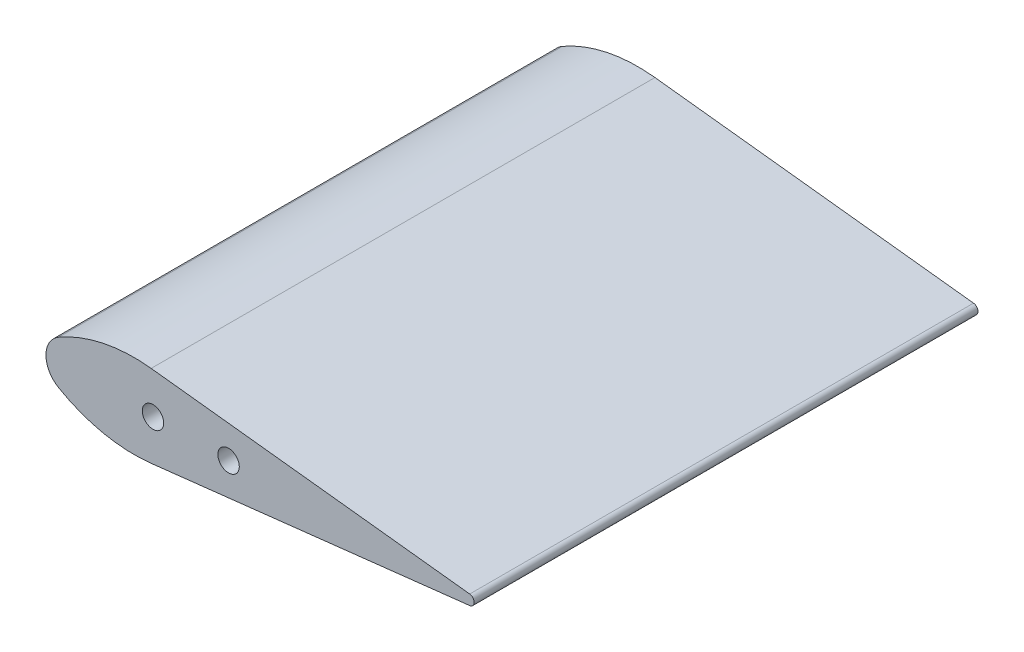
ISO-10303-21;
HEADER;
FILE_DESCRIPTION(('STEP AP214'),'2;1');
FILE_NAME('part.step','',(''),(''),'','','');
FILE_SCHEMA(('AUTOMOTIVE_DESIGN { 1 0 10303 214 1 1 1 1 }'));
ENDSEC;
DATA;
#1=APPLICATION_CONTEXT('core data for automotive mechanical design processes');
#2=APPLICATION_PROTOCOL_DEFINITION('international standard','automotive_design',2000,#1);
#3=PRODUCT_CONTEXT('',#1,'mechanical');
#4=PRODUCT('Part','Part','',(#3));
#5=PRODUCT_RELATED_PRODUCT_CATEGORY('part','',(#4));
#6=PRODUCT_DEFINITION_FORMATION('','',#4);
#7=PRODUCT_DEFINITION_CONTEXT('part definition',#1,'design');
#8=PRODUCT_DEFINITION('design','',#6,#7);
#9=PRODUCT_DEFINITION_SHAPE('','',#8);
#10=(LENGTH_UNIT() NAMED_UNIT(*) SI_UNIT(.MILLI.,.METRE.));
#11=(NAMED_UNIT(*) PLANE_ANGLE_UNIT() SI_UNIT($,.RADIAN.));
#12=(NAMED_UNIT(*) SI_UNIT($,.STERADIAN.) SOLID_ANGLE_UNIT());
#13=UNCERTAINTY_MEASURE_WITH_UNIT(LENGTH_MEASURE(1.E-05),#10,'distance_accuracy_value','');
#14=(GEOMETRIC_REPRESENTATION_CONTEXT(3) GLOBAL_UNCERTAINTY_ASSIGNED_CONTEXT((#13)) GLOBAL_UNIT_ASSIGNED_CONTEXT((#10,
#11,#12)) REPRESENTATION_CONTEXT('',''));
#15=CARTESIAN_POINT('',(0.,0.,0.));
#16=DIRECTION('',(0.,0.,1.));
#17=DIRECTION('',(1.,0.,0.));
#18=AXIS2_PLACEMENT_3D('',#15,#16,#17);
#19=CARTESIAN_POINT('',(-160.000000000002,1.08940634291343E-12,200.));
#20=DIRECTION('',(0.,0.,-1.));
#21=DIRECTION('',(-1.,0.,0.));
#22=AXIS2_PLACEMENT_3D('',#19,#20,#21);
#23=CYLINDRICAL_SURFACE('',#22,10.);
#24=CARTESIAN_POINT('',(-160.000000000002,5.41233724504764E-13,0.));
#25=DIRECTION('',(0.,0.,1.));
#26=DIRECTION('',(1.,0.,0.));
#27=AXIS2_PLACEMENT_3D('',#24,#25,#26);
#28=CIRCLE('',#27,10.);
#29=CARTESIAN_POINT('',(-165.,8.66025403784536,-8.1601392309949E-12));
#30=VERTEX_POINT('',#29);
#31=CARTESIAN_POINT('',(-165.,-8.66025403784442,-8.1601392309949E-12));
#32=VERTEX_POINT('',#31);
#33=EDGE_CURVE('E131',#30,#32,#28,.T.);
#34=ORIENTED_EDGE('',*,*,#33,.T.);
#35=DIRECTION('',(0.,0.,-1.));
#36=VECTOR('',#35,1.);
#37=CARTESIAN_POINT('',(-165.,-8.66025403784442,199.999999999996));
#38=LINE('',#37,#36);
#39=CARTESIAN_POINT('',(-165.,-8.66025403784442,199.999999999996));
#40=VERTEX_POINT('',#39);
#41=EDGE_CURVE('E128',#40,#32,#38,.T.);
#42=ORIENTED_EDGE('',*,*,#41,.F.);
#43=CARTESIAN_POINT('',(-160.000000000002,1.08940634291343E-12,200.));
#44=DIRECTION('',(0.,0.,1.));
#45=DIRECTION('',(1.,0.,0.));
#46=AXIS2_PLACEMENT_3D('',#43,#44,#45);
#47=CIRCLE('',#46,10.);
#48=CARTESIAN_POINT('',(-165.000000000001,8.66025403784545,199.999999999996));
#49=VERTEX_POINT('',#48);
#50=EDGE_CURVE('E139',#49,#40,#47,.T.);
#51=ORIENTED_EDGE('',*,*,#50,.F.);
#52=DIRECTION('',(0.,0.,-1.));
#53=VECTOR('',#52,1.);
#54=CARTESIAN_POINT('',(-165.000000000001,8.66025403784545,199.999999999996));
#55=LINE('',#54,#53);
#56=EDGE_CURVE('E145',#49,#30,#55,.T.);
#57=ORIENTED_EDGE('',*,*,#56,.T.);
#58=EDGE_LOOP('',(#34,#42,#51,#57));
#59=FACE_BOUND('',#58,.T.);
#60=ADVANCED_FACE('F36',(#59),#23,.T.);
#61=CARTESIAN_POINT('',(-1.99999999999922,1.06858966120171E-12,200.));
#62=DIRECTION('',(0.,0.,-1.));
#63=DIRECTION('',(-1.,0.,0.));
#64=AXIS2_PLACEMENT_3D('',#61,#62,#63);
#65=CYLINDRICAL_SURFACE('',#64,2.00000000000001);
#66=CARTESIAN_POINT('',(-1.9999999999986,5.89805981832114E-13,-8.1601392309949E-12));
#67=DIRECTION('',(0.,0.,1.));
#68=DIRECTION('',(1.,0.,0.));
#69=AXIS2_PLACEMENT_3D('',#66,#67,#68);
#70=CIRCLE('',#69,2.00000000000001);
#71=CARTESIAN_POINT('',(-1.77482640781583,-1.98728378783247,-8.1601392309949E-12));
#72=VERTEX_POINT('',#71);
#73=CARTESIAN_POINT('',(-1.77482640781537,1.98728378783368,-8.1601392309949E-12));
#74=VERTEX_POINT('',#73);
#75=EDGE_CURVE('E133',#72,#74,#70,.T.);
#76=ORIENTED_EDGE('',*,*,#75,.T.);
#77=DIRECTION('',(0.,0.,-1.));
#78=VECTOR('',#77,1.);
#79=CARTESIAN_POINT('',(-1.77482640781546,1.98728378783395,200.));
#80=LINE('',#79,#78);
#81=CARTESIAN_POINT('',(-1.77482640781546,1.98728378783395,200.));
#82=VERTEX_POINT('',#81);
#83=EDGE_CURVE('E11',#82,#74,#80,.T.);
#84=ORIENTED_EDGE('',*,*,#83,.F.);
#85=CARTESIAN_POINT('',(-1.99999999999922,1.06858966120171E-12,200.));
#86=DIRECTION('',(0.,0.,1.));
#87=DIRECTION('',(1.,0.,0.));
#88=AXIS2_PLACEMENT_3D('',#85,#86,#87);
#89=CIRCLE('',#88,2.00000000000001);
#90=CARTESIAN_POINT('',(-1.77482640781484,-1.987283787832,200.));
#91=VERTEX_POINT('',#90);
#92=EDGE_CURVE('E141',#91,#82,#89,.T.);
#93=ORIENTED_EDGE('',*,*,#92,.F.);
#94=DIRECTION('',(0.,0.,-1.));
#95=VECTOR('',#94,1.);
#96=CARTESIAN_POINT('',(-1.77482640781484,-1.987283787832,200.));
#97=LINE('',#96,#95);
#98=EDGE_CURVE('E123',#91,#72,#97,.T.);
#99=ORIENTED_EDGE('',*,*,#98,.T.);
#100=EDGE_LOOP('',(#76,#84,#93,#99));
#101=FACE_BOUND('',#100,.T.);
#102=ADVANCED_FACE('F170',(#101),#65,.T.);
#103=CARTESIAN_POINT('',(-128.2447922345,16.3172434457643,199.999999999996));
#104=DIRECTION('',(-0.112586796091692,-0.993641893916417,0.));
#105=DIRECTION('',(0.993641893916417,-0.112586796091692,0.));
#106=AXIS2_PLACEMENT_3D('',#103,#104,#105);
#107=PLANE('',#106);
#108=DIRECTION('',(-0.993641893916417,0.112586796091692,0.));
#109=VECTOR('',#108,1.);
#110=CARTESIAN_POINT('',(-128.244792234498,16.3172434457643,-8.1601392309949E-12));
#111=LINE('',#110,#109);
#112=CARTESIAN_POINT('',(-128.244792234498,16.3172434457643,-8.1601392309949E-12));
#113=VERTEX_POINT('',#112);
#114=EDGE_CURVE('E135',#74,#113,#111,.T.);
#115=ORIENTED_EDGE('',*,*,#114,.T.);
#116=DIRECTION('',(0.,0.,-1.));
#117=VECTOR('',#116,1.);
#118=CARTESIAN_POINT('',(-128.2447922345,16.3172434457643,199.999999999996));
#119=LINE('',#118,#117);
#120=CARTESIAN_POINT('',(-128.2447922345,16.3172434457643,199.999999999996));
#121=VERTEX_POINT('',#120);
#122=EDGE_CURVE('E43',#121,#113,#119,.T.);
#123=ORIENTED_EDGE('',*,*,#122,.F.);
#124=DIRECTION('',(-0.993641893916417,0.112586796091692,0.));
#125=VECTOR('',#124,1.);
#126=CARTESIAN_POINT('',(-128.2447922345,16.3172434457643,199.999999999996));
#127=LINE('',#126,#125);
#128=EDGE_CURVE('E55',#82,#121,#127,.T.);
#129=ORIENTED_EDGE('',*,*,#128,.F.);
#130=ORIENTED_EDGE('',*,*,#83,.T.);
#131=EDGE_LOOP('',(#115,#123,#129,#130));
#132=FACE_BOUND('',#131,.T.);
#133=ADVANCED_FACE('F172',(#132),#107,.F.);
#134=CARTESIAN_POINT('',(-135.,-43.3012701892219,199.999999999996));
#135=DIRECTION('',(0.,0.,-1.));
#136=DIRECTION('',(-1.,0.,0.));
#137=AXIS2_PLACEMENT_3D('',#134,#135,#136);
#138=CYLINDRICAL_SURFACE('',#137,60.);
#139=CARTESIAN_POINT('',(-135.,-43.3012701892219,0.));
#140=DIRECTION('',(0.,0.,1.));
#141=DIRECTION('',(1.,0.,0.));
#142=AXIS2_PLACEMENT_3D('',#139,#140,#141);
#143=CIRCLE('',#142,60.);
#144=EDGE_CURVE('E137',#113,#30,#143,.T.);
#145=ORIENTED_EDGE('',*,*,#144,.T.);
#146=ORIENTED_EDGE('',*,*,#56,.F.);
#147=CARTESIAN_POINT('',(-135.,-43.3012701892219,199.999999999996));
#148=DIRECTION('',(0.,0.,1.));
#149=DIRECTION('',(1.,0.,0.));
#150=AXIS2_PLACEMENT_3D('',#147,#148,#149);
#151=CIRCLE('',#150,60.);
#152=EDGE_CURVE('E50',#121,#49,#151,.T.);
#153=ORIENTED_EDGE('',*,*,#152,.F.);
#154=ORIENTED_EDGE('',*,*,#122,.T.);
#155=EDGE_LOOP('',(#145,#146,#153,#154));
#156=FACE_BOUND('',#155,.T.);
#157=ADVANCED_FACE('F150',(#156),#138,.T.);
#158=CARTESIAN_POINT('',(-160.000000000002,1.08940634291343E-12,200.));
#159=DIRECTION('',(0.,0.,1.));
#160=DIRECTION('',(1.,0.,0.));
#161=AXIS2_PLACEMENT_3D('',#158,#159,#160);
#162=PLANE('',#161);
#163=CARTESIAN_POINT('',(-127.500000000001,7.42461647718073E-13,200.));
#164=DIRECTION('',(0.,0.,1.));
#165=DIRECTION('',(1.,0.,0.));
#166=AXIS2_PLACEMENT_3D('',#163,#164,#165);
#167=CIRCLE('',#166,4.24999999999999);
#168=CARTESIAN_POINT('',(-123.250000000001,7.42461647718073E-13,200.));
#169=VERTEX_POINT('',#168);
#170=EDGE_CURVE('E100',#169,#169,#167,.T.);
#171=ORIENTED_EDGE('',*,*,#170,.F.);
#172=EDGE_LOOP('',(#171));
#173=FACE_BOUND('',#172,.T.);
#174=CARTESIAN_POINT('',(-97.4999999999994,9.85322934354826E-13,199.999999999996));
#175=DIRECTION('',(0.,0.,1.));
#176=DIRECTION('',(1.,0.,0.));
#177=AXIS2_PLACEMENT_3D('',#174,#175,#176);
#178=CIRCLE('',#177,4.24999999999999);
#179=CARTESIAN_POINT('',(-93.2499999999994,9.85322934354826E-13,199.999999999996));
#180=VERTEX_POINT('',#179);
#181=EDGE_CURVE('E108',#180,#180,#178,.T.);
#182=ORIENTED_EDGE('',*,*,#181,.F.);
#183=EDGE_LOOP('',(#182));
#184=FACE_BOUND('',#183,.T.);
#185=ORIENTED_EDGE('',*,*,#50,.T.);
#186=CARTESIAN_POINT('',(-135.,43.3012701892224,200.));
#187=DIRECTION('',(0.,0.,-1.));
#188=DIRECTION('',(1.00000000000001,0.,0.));
#189=AXIS2_PLACEMENT_3D('',#186,#187,#188);
#190=CIRCLE('',#189,60.);
#191=CARTESIAN_POINT('',(-128.244792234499,-16.317243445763,199.999999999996));
#192=VERTEX_POINT('',#191);
#193=EDGE_CURVE('E117',#192,#40,#190,.T.);
#194=ORIENTED_EDGE('',*,*,#193,.F.);
#195=DIRECTION('',(-0.993641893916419,-0.112586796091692,0.));
#196=VECTOR('',#195,1.);
#197=CARTESIAN_POINT('',(-128.244792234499,-16.317243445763,199.999999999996));
#198=LINE('',#197,#196);
#199=EDGE_CURVE('E120',#91,#192,#198,.T.);
#200=ORIENTED_EDGE('',*,*,#199,.F.);
#201=ORIENTED_EDGE('',*,*,#92,.T.);
#202=ORIENTED_EDGE('',*,*,#128,.T.);
#203=ORIENTED_EDGE('',*,*,#152,.T.);
#204=EDGE_LOOP('',(#185,#194,#200,#201,#202,#203));
#205=FACE_BOUND('',#204,.T.);
#206=ADVANCED_FACE('F164',(#173,#184,#205),#162,.T.);
#207=CARTESIAN_POINT('',(-160.000000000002,5.41233724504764E-13,0.));
#208=DIRECTION('',(0.,0.,1.));
#209=DIRECTION('',(1.,0.,0.));
#210=AXIS2_PLACEMENT_3D('',#207,#208,#209);
#211=PLANE('',#210);
#212=ORIENTED_EDGE('',*,*,#33,.F.);
#213=ORIENTED_EDGE('',*,*,#144,.F.);
#214=ORIENTED_EDGE('',*,*,#114,.F.);
#215=ORIENTED_EDGE('',*,*,#75,.F.);
#216=DIRECTION('',(-0.993641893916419,-0.112586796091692,0.));
#217=VECTOR('',#216,1.);
#218=CARTESIAN_POINT('',(-128.244792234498,-16.3172434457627,-8.1601392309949E-12));
#219=LINE('',#218,#217);
#220=CARTESIAN_POINT('',(-128.244792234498,-16.3172434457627,-8.1601392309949E-12));
#221=VERTEX_POINT('',#220);
#222=EDGE_CURVE('E114',#72,#221,#219,.T.);
#223=ORIENTED_EDGE('',*,*,#222,.T.);
#224=CARTESIAN_POINT('',(-135.,43.3012701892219,0.));
#225=DIRECTION('',(0.,0.,-1.));
#226=DIRECTION('',(1.00000000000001,0.,0.));
#227=AXIS2_PLACEMENT_3D('',#224,#225,#226);
#228=CIRCLE('',#227,60.);
#229=EDGE_CURVE('E111',#221,#32,#228,.T.);
#230=ORIENTED_EDGE('',*,*,#229,.T.);
#231=EDGE_LOOP('',(#212,#213,#214,#215,#223,#230));
#232=FACE_BOUND('',#231,.T.);
#233=ADVANCED_FACE('F155',(#232),#211,.F.);
#234=CARTESIAN_POINT('',(-135.,43.3012701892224,200.));
#235=DIRECTION('',(0.,0.,-1.));
#236=DIRECTION('',(-1.,0.,0.));
#237=AXIS2_PLACEMENT_3D('',#234,#235,#236);
#238=CYLINDRICAL_SURFACE('',#237,60.);
#239=ORIENTED_EDGE('',*,*,#229,.F.);
#240=DIRECTION('',(0.,0.,-1.));
#241=VECTOR('',#240,1.);
#242=CARTESIAN_POINT('',(-128.244792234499,-16.317243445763,199.999999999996));
#243=LINE('',#242,#241);
#244=EDGE_CURVE('E126',#192,#221,#243,.T.);
#245=ORIENTED_EDGE('',*,*,#244,.F.);
#246=ORIENTED_EDGE('',*,*,#193,.T.);
#247=ORIENTED_EDGE('',*,*,#41,.T.);
#248=EDGE_LOOP('',(#239,#245,#246,#247));
#249=FACE_BOUND('',#248,.T.);
#250=ADVANCED_FACE('F161',(#249),#238,.T.);
#251=CARTESIAN_POINT('',(-128.244792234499,-16.317243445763,199.999999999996));
#252=DIRECTION('',(0.112586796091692,-0.993641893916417,0.));
#253=DIRECTION('',(0.993641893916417,0.112586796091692,0.));
#254=AXIS2_PLACEMENT_3D('',#251,#252,#253);
#255=PLANE('',#254);
#256=ORIENTED_EDGE('',*,*,#222,.F.);
#257=ORIENTED_EDGE('',*,*,#98,.F.);
#258=ORIENTED_EDGE('',*,*,#199,.T.);
#259=ORIENTED_EDGE('',*,*,#244,.T.);
#260=EDGE_LOOP('',(#256,#257,#258,#259));
#261=FACE_BOUND('',#260,.T.);
#262=ADVANCED_FACE('F168',(#261),#255,.T.);
#263=CARTESIAN_POINT('',(-97.4999999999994,9.85322934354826E-13,199.999999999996));
#264=DIRECTION('',(0.,0.,1.));
#265=DIRECTION('',(1.,0.,0.));
#266=AXIS2_PLACEMENT_3D('',#263,#264,#265);
#267=CYLINDRICAL_SURFACE('',#266,4.24999999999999);
#268=CARTESIAN_POINT('',(-97.500000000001,9.47159017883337E-13,175.499999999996));
#269=DIRECTION('',(0.,0.,1.));
#270=DIRECTION('',(1.,0.,0.));
#271=AXIS2_PLACEMENT_3D('',#268,#269,#270);
#272=CIRCLE('',#271,4.24999999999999);
#273=CARTESIAN_POINT('',(-93.250000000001,9.47159017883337E-13,175.499999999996));
#274=VERTEX_POINT('',#273);
#275=EDGE_CURVE('E103',#274,#274,#272,.T.);
#276=ORIENTED_EDGE('',*,*,#275,.F.);
#277=EDGE_LOOP('',(#276));
#278=FACE_BOUND('',#277,.T.);
#279=ORIENTED_EDGE('',*,*,#181,.T.);
#280=EDGE_LOOP('',(#279));
#281=FACE_BOUND('',#280,.T.);
#282=ADVANCED_FACE('F214',(#278,#281),#267,.F.);
#283=CARTESIAN_POINT('',(-97.500000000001,9.47159017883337E-13,175.499999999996));
#284=DIRECTION('',(0.,0.,1.));
#285=DIRECTION('',(1.,0.,0.));
#286=AXIS2_PLACEMENT_3D('',#283,#284,#285);
#287=CONICAL_SURFACE('',#286,4.24999999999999,1.02974425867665);
#288=CARTESIAN_POINT('',(-97.4999999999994,9.36750677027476E-13,172.946342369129));
#289=VERTEX_POINT('',#288);
#290=VERTEX_LOOP('',#289);
#291=FACE_BOUND('',#290,.T.);
#292=ORIENTED_EDGE('',*,*,#275,.T.);
#293=EDGE_LOOP('',(#292));
#294=FACE_BOUND('',#293,.T.);
#295=ADVANCED_FACE('F220',(#291,#294),#287,.F.);
#296=CARTESIAN_POINT('',(-127.500000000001,7.42461647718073E-13,200.));
#297=DIRECTION('',(0.,0.,1.));
#298=DIRECTION('',(1.,0.,0.));
#299=AXIS2_PLACEMENT_3D('',#296,#297,#298);
#300=CYLINDRICAL_SURFACE('',#299,4.24999999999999);
#301=CARTESIAN_POINT('',(-127.500000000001,5.3776427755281E-13,175.5));
#302=DIRECTION('',(0.,0.,1.));
#303=DIRECTION('',(1.,0.,0.));
#304=AXIS2_PLACEMENT_3D('',#301,#302,#303);
#305=CIRCLE('',#304,4.24999999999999);
#306=CARTESIAN_POINT('',(-123.250000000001,5.3776427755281E-13,175.5));
#307=VERTEX_POINT('',#306);
#308=EDGE_CURVE('E98',#307,#307,#305,.T.);
#309=ORIENTED_EDGE('',*,*,#308,.F.);
#310=EDGE_LOOP('',(#309));
#311=FACE_BOUND('',#310,.T.);
#312=ORIENTED_EDGE('',*,*,#170,.T.);
#313=EDGE_LOOP('',(#312));
#314=FACE_BOUND('',#313,.T.);
#315=ADVANCED_FACE('F94',(#311,#314),#300,.F.);
#316=CARTESIAN_POINT('',(-127.500000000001,5.3776427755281E-13,175.5));
#317=DIRECTION('',(0.,0.,1.));
#318=DIRECTION('',(1.,0.,0.));
#319=AXIS2_PLACEMENT_3D('',#316,#317,#318);
#320=CONICAL_SURFACE('',#319,4.24999999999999,1.02974425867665);
#321=CARTESIAN_POINT('',(-127.500000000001,8.11850586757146E-13,172.946342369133));
#322=VERTEX_POINT('',#321);
#323=VERTEX_LOOP('',#322);
#324=FACE_BOUND('',#323,.T.);
#325=ORIENTED_EDGE('',*,*,#308,.T.);
#326=EDGE_LOOP('',(#325));
#327=FACE_BOUND('',#326,.T.);
#328=ADVANCED_FACE('F91',(#324,#327),#320,.F.);
#329=CLOSED_SHELL('',(#60,#102,#133,#157,#206,#233,#250,#262,#282,#295,#315,#328));
#330=MANIFOLD_SOLID_BREP('B2',#329);
#331=ADVANCED_BREP_SHAPE_REPRESENTATION('',(#18,#330),#14);
#332=SHAPE_DEFINITION_REPRESENTATION(#9,#331);
ENDSEC;
END-ISO-10303-21;
